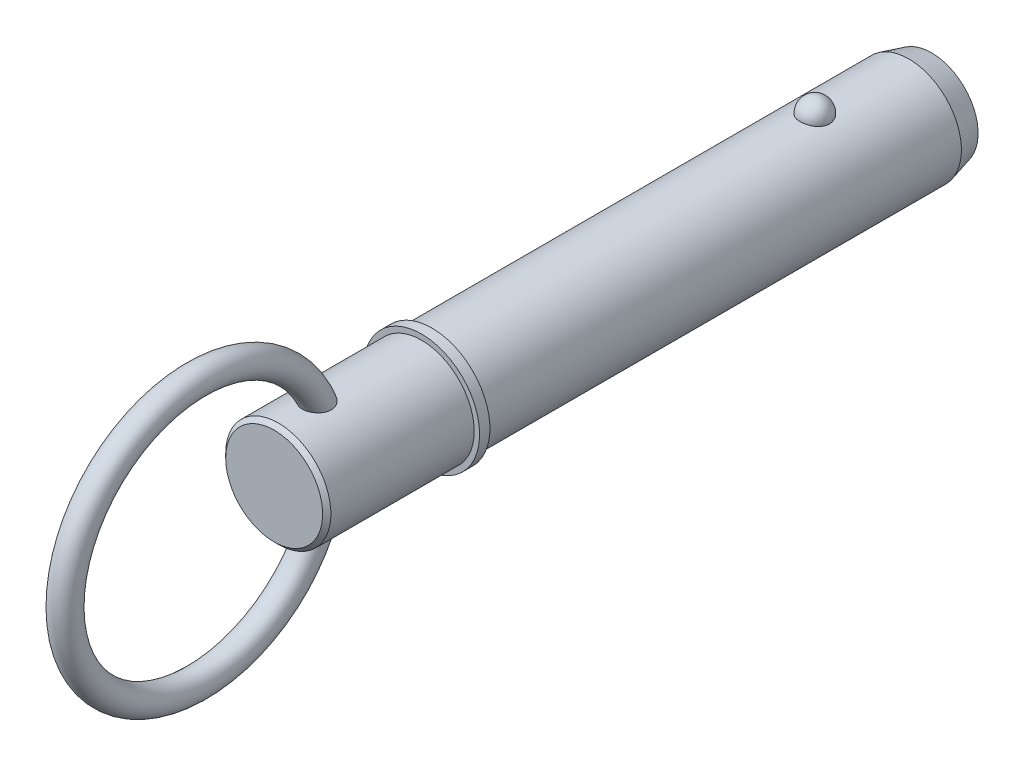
from build123d import *

# Parameters (mm, degrees)
SKETCH2_R           = 12.7
BOSS_EXTRUDE1_DEPTH = 88.9
BOSS_EXTRUDE2_START = 31.75
SKETCH3_R           = 12.7
BOSS_EXTRUDE2_DEPTH = 31.75
CHAMFER1_SIZE       = 5.5
CHAMFER1_SIZE2      = 1.473720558
SKETCH20_W          = 2.5
SKETCH20_H          = 14
SKETCH21_R          = 12.7
BOSS_EXTRUDE3_DEPTH = 38.1
CHAMFER2_SIZE       = 1
SKETCH24_R          = 3.25


with BuildPart() as part:
    # Sketch2 → Boss-Extrude1 (new body)
    with BuildSketch(Plane.XY):
        Circle(SKETCH2_R)
    extrude(amount=BOSS_EXTRUDE1_DEPTH)

    # Sketch3 → Boss-Extrude2 (add)
    with BuildSketch(Plane(origin=(0, 0, 0), x_dir=(-1, 0, 0), z_dir=(0, 0, -1)).offset(BOSS_EXTRUDE2_START)):
        Circle(SKETCH3_R)
    extrude(amount=-BOSS_EXTRUDE2_DEPTH)

    # Chamfer1
    chamfer1_edges = [part.edges().sort_by_distance(p)[0] for p in [
        (12.7, 0, -31.75),
    ]]
    chamfer1_side = [part.faces().sort_by_distance(p)[0] for p in [
        (12.7, 0, -15.875),
    ]]
    chamfer(chamfer1_edges, length=CHAMFER1_SIZE, length2=CHAMFER1_SIZE2, reference=chamfer1_side[0])

    # Sketch18 → Revolve1 (revolve)
    with BuildSketch(Plane(origin=(0, 0, 0), x_dir=(0, 0, -1), z_dir=(1, 0, 0))):
        with BuildLine():
            Line((3.56, 16.26), (3.56, 9.14))
            ThreePointArc((3.56, 9.14), (0, 12.7), (3.56, 16.26))
        make_face()
    revolve(axis=Axis((0, 16.26, -3.56), (0, -1, 0)))

    # Sketch20 → Revolve2 (revolve)
    with BuildSketch(Plane(origin=(0, 0, 0), x_dir=(0, 0, -1), z_dir=(1, 0, 0)), mode=Mode.PRIVATE) as revolve2_sk:
        with Locations((-90.15, 7)):
            Rectangle(SKETCH20_W, SKETCH20_H)
    revolve(revolve2_sk.sketch.rotate(Axis((0, 0, 33.728787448), (0, 0, 1)), 90), axis=Axis((0, 0, 33.728787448), (0, 0, 1)))

    # Sketch21 → Boss-Extrude3 (add)
    with BuildSketch(Plane(origin=(0, 0, 88.9), x_dir=(-1, 0, 0), z_dir=(0, 0, -1))):
        Circle(SKETCH21_R)
    extrude(amount=-BOSS_EXTRUDE3_DEPTH)

    # Chamfer2
    chamfer2_edges = [part.edges().sort_by_distance(p)[0] for p in [
        (12.7, 0, 127),
    ]]
    chamfer(chamfer2_edges, length=CHAMFER2_SIZE)

    # Sweep1: sweep along a path in Sketch23
    with BuildLine(Plane(origin=(0, 0, 0), x_dir=(0, 0, -1), z_dir=(1, 0, 0))) as sweep1_path:
        CenterArc((-145.75, 0), 31.75, 0, 360)
    # Sketch24 → Sweep1 (sweep)
    with BuildSketch(Plane(origin=(0, 0, 0), x_dir=(1, 0, 0), z_dir=(0, 1, 0))):
        with Locations((0, -114)):
            Circle(SKETCH24_R)
    sweep(path=sweep1_path.line)


solid = part.part
